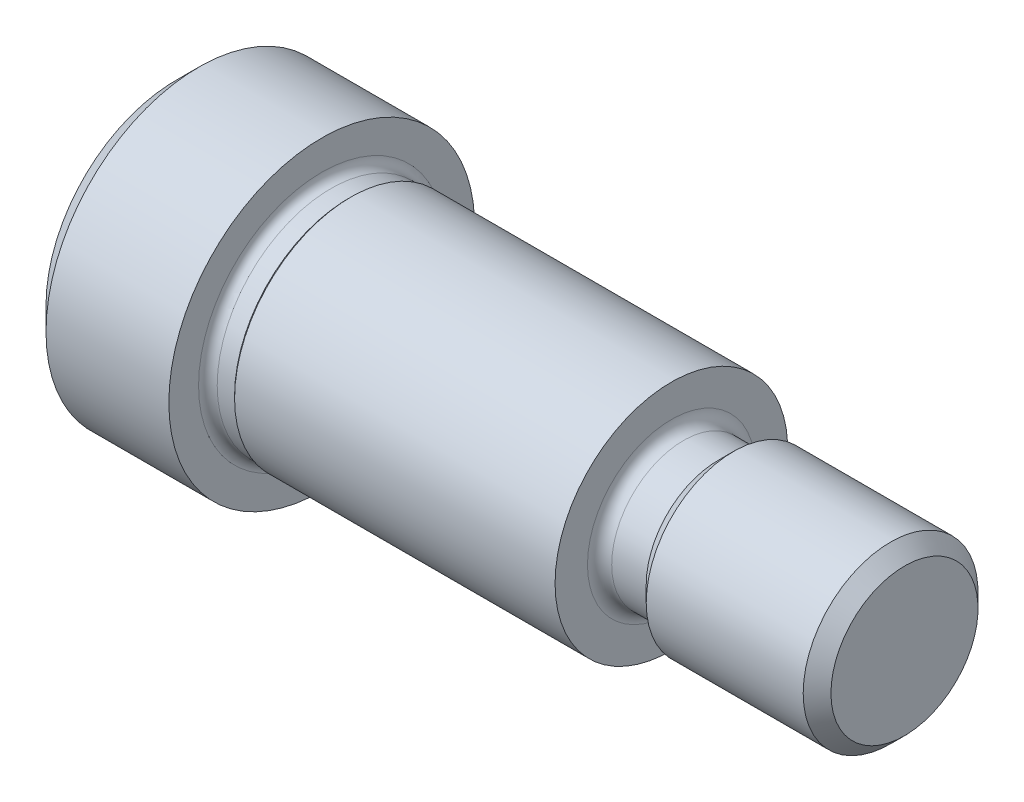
ISO-10303-21;
HEADER;
FILE_DESCRIPTION(('STEP AP214'),'2;1');
FILE_NAME('part.step','',(''),(''),'','','');
FILE_SCHEMA(('AUTOMOTIVE_DESIGN { 1 0 10303 214 1 1 1 1 }'));
ENDSEC;
DATA;
#1=APPLICATION_CONTEXT('core data for automotive mechanical design processes');
#2=APPLICATION_PROTOCOL_DEFINITION('international standard','automotive_design',2000,#1);
#3=PRODUCT_CONTEXT('',#1,'mechanical');
#4=PRODUCT('Part','Part','',(#3));
#5=PRODUCT_RELATED_PRODUCT_CATEGORY('part','',(#4));
#6=PRODUCT_DEFINITION_FORMATION('','',#4);
#7=PRODUCT_DEFINITION_CONTEXT('part definition',#1,'design');
#8=PRODUCT_DEFINITION('design','',#6,#7);
#9=PRODUCT_DEFINITION_SHAPE('','',#8);
#10=(LENGTH_UNIT() NAMED_UNIT(*) SI_UNIT(.MILLI.,.METRE.));
#11=(NAMED_UNIT(*) PLANE_ANGLE_UNIT() SI_UNIT($,.RADIAN.));
#12=(NAMED_UNIT(*) SI_UNIT($,.STERADIAN.) SOLID_ANGLE_UNIT());
#13=UNCERTAINTY_MEASURE_WITH_UNIT(LENGTH_MEASURE(1.E-05),#10,'distance_accuracy_value','');
#14=(GEOMETRIC_REPRESENTATION_CONTEXT(3) GLOBAL_UNCERTAINTY_ASSIGNED_CONTEXT((#13)) GLOBAL_UNIT_ASSIGNED_CONTEXT((#10,
#11,#12)) REPRESENTATION_CONTEXT('',''));
#15=CARTESIAN_POINT('',(0.,0.,0.));
#16=DIRECTION('',(0.,0.,1.));
#17=DIRECTION('',(1.,0.,0.));
#18=AXIS2_PLACEMENT_3D('',#15,#16,#17);
#19=CARTESIAN_POINT('',(0.,0.,0.));
#20=DIRECTION('',(-1.,0.,0.));
#21=DIRECTION('',(0.,0.,1.));
#22=AXIS2_PLACEMENT_3D('',#19,#20,#21);
#23=PLANE('',#22);
#24=CARTESIAN_POINT('',(0.,0.,0.));
#25=DIRECTION('',(-1.,0.,0.));
#26=DIRECTION('',(0.,0.,1.));
#27=AXIS2_PLACEMENT_3D('',#24,#25,#26);
#28=CIRCLE('',#27,14.1732);
#29=CARTESIAN_POINT('',(0.,0.,14.1732));
#30=VERTEX_POINT('',#29);
#31=EDGE_CURVE('E11',#30,#30,#28,.T.);
#32=ORIENTED_EDGE('',*,*,#31,.T.);
#33=EDGE_LOOP('',(#32));
#34=FACE_BOUND('',#33,.T.);
#35=DIRECTION('',(0.,-0.5,-0.866025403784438));
#36=VECTOR('',#35,1.);
#37=CARTESIAN_POINT('',(0.,-3.6661742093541,6.35000000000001));
#38=LINE('',#37,#36);
#39=CARTESIAN_POINT('',(0.,-3.6661742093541,6.35000000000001));
#40=VERTEX_POINT('',#39);
#41=CARTESIAN_POINT('',(0.,-7.33234841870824,0.));
#42=VERTEX_POINT('',#41);
#43=EDGE_CURVE('E47',#40,#42,#38,.T.);
#44=ORIENTED_EDGE('',*,*,#43,.T.);
#45=DIRECTION('',(0.,0.500000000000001,-0.866025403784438));
#46=VECTOR('',#45,1.);
#47=CARTESIAN_POINT('',(0.,-7.33234841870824,0.));
#48=LINE('',#47,#46);
#49=CARTESIAN_POINT('',(0.,-3.6661742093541,-6.35));
#50=VERTEX_POINT('',#49);
#51=EDGE_CURVE('E476',#42,#50,#48,.T.);
#52=ORIENTED_EDGE('',*,*,#51,.T.);
#53=DIRECTION('',(0.,1.,0.));
#54=VECTOR('',#53,1.);
#55=CARTESIAN_POINT('',(0.,-3.6661742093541,-6.35));
#56=LINE('',#55,#54);
#57=CARTESIAN_POINT('',(0.,3.66617420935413,-6.35));
#58=VERTEX_POINT('',#57);
#59=EDGE_CURVE('E127',#50,#58,#56,.T.);
#60=ORIENTED_EDGE('',*,*,#59,.T.);
#61=DIRECTION('',(0.,0.500000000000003,0.866025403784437));
#62=VECTOR('',#61,1.);
#63=CARTESIAN_POINT('',(0.,3.66617420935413,-6.35));
#64=LINE('',#63,#62);
#65=CARTESIAN_POINT('',(0.,7.33234841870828,0.));
#66=VERTEX_POINT('',#65);
#67=EDGE_CURVE('E479',#58,#66,#64,.T.);
#68=ORIENTED_EDGE('',*,*,#67,.T.);
#69=DIRECTION('',(0.,-0.500000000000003,0.866025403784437));
#70=VECTOR('',#69,1.);
#71=CARTESIAN_POINT('',(0.,7.33234841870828,0.));
#72=LINE('',#71,#70);
#73=CARTESIAN_POINT('',(0.,3.66617420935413,6.35000000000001));
#74=VERTEX_POINT('',#73);
#75=EDGE_CURVE('E481',#66,#74,#72,.T.);
#76=ORIENTED_EDGE('',*,*,#75,.T.);
#77=DIRECTION('',(0.,-1.,0.));
#78=VECTOR('',#77,1.);
#79=CARTESIAN_POINT('',(0.,3.66617420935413,6.35000000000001));
#80=LINE('',#79,#78);
#81=EDGE_CURVE('E483',#74,#40,#80,.T.);
#82=ORIENTED_EDGE('',*,*,#81,.T.);
#83=EDGE_LOOP('',(#44,#52,#60,#68,#76,#82));
#84=FACE_BOUND('',#83,.T.);
#85=ADVANCED_FACE('F33',(#34,#84),#23,.T.);
#86=CARTESIAN_POINT('',(0.,0.,0.));
#87=DIRECTION('',(1.,0.,0.));
#88=DIRECTION('',(0.,0.,-1.));
#89=AXIS2_PLACEMENT_3D('',#86,#87,#88);
#90=CONICAL_SURFACE('',#89,14.1732,0.785398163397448);
#91=CARTESIAN_POINT('',(2.48919999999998,0.,0.));
#92=DIRECTION('',(-1.,0.,0.));
#93=DIRECTION('',(0.,0.,1.));
#94=AXIS2_PLACEMENT_3D('',#91,#92,#93);
#95=CIRCLE('',#94,16.6624);
#96=CARTESIAN_POINT('',(2.48919999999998,0.,16.6624));
#97=VERTEX_POINT('',#96);
#98=EDGE_CURVE('E40',#97,#97,#95,.T.);
#99=ORIENTED_EDGE('',*,*,#98,.T.);
#100=EDGE_LOOP('',(#99));
#101=FACE_BOUND('',#100,.T.);
#102=ORIENTED_EDGE('',*,*,#31,.F.);
#103=EDGE_LOOP('',(#102));
#104=FACE_BOUND('',#103,.T.);
#105=ADVANCED_FACE('F179',(#101,#104),#90,.T.);
#106=CARTESIAN_POINT('',(-6.34999999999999,0.,0.));
#107=DIRECTION('',(-1.,0.,0.));
#108=DIRECTION('',(0.,0.,1.));
#109=AXIS2_PLACEMENT_3D('',#106,#107,#108);
#110=CYLINDRICAL_SURFACE('',#109,16.6624);
#111=CARTESIAN_POINT('',(15.875,0.,0.));
#112=DIRECTION('',(-1.,0.,0.));
#113=DIRECTION('',(0.,0.,1.));
#114=AXIS2_PLACEMENT_3D('',#111,#112,#113);
#115=CIRCLE('',#114,16.6624);
#116=CARTESIAN_POINT('',(15.875,0.,16.6624));
#117=VERTEX_POINT('',#116);
#118=EDGE_CURVE('E174',#117,#117,#115,.T.);
#119=ORIENTED_EDGE('',*,*,#118,.T.);
#120=EDGE_LOOP('',(#119));
#121=FACE_BOUND('',#120,.T.);
#122=ORIENTED_EDGE('',*,*,#98,.F.);
#123=EDGE_LOOP('',(#122));
#124=FACE_BOUND('',#123,.T.);
#125=ADVANCED_FACE('F182',(#121,#124),#110,.T.);
#126=CARTESIAN_POINT('',(15.875,16.6624,0.));
#127=DIRECTION('',(1.,0.,0.));
#128=DIRECTION('',(0.,0.,-1.));
#129=AXIS2_PLACEMENT_3D('',#126,#127,#128);
#130=PLANE('',#129);
#131=CARTESIAN_POINT('',(15.875,0.,0.));
#132=DIRECTION('',(-1.,0.,0.));
#133=DIRECTION('',(0.,0.,1.));
#134=AXIS2_PLACEMENT_3D('',#131,#132,#133);
#135=CIRCLE('',#134,13.4239);
#136=CARTESIAN_POINT('',(15.875,0.,13.4239));
#137=VERTEX_POINT('',#136);
#138=EDGE_CURVE('E171',#137,#137,#135,.T.);
#139=ORIENTED_EDGE('',*,*,#138,.T.);
#140=EDGE_LOOP('',(#139));
#141=FACE_BOUND('',#140,.T.);
#142=ORIENTED_EDGE('',*,*,#118,.F.);
#143=EDGE_LOOP('',(#142));
#144=FACE_BOUND('',#143,.T.);
#145=ADVANCED_FACE('F184',(#141,#144),#130,.T.);
#146=CARTESIAN_POINT('',(16.891,0.,0.));
#147=DIRECTION('',(-1.,0.,0.));
#148=DIRECTION('',(0.,0.,1.));
#149=AXIS2_PLACEMENT_3D('',#146,#147,#148);
#150=TOROIDAL_SURFACE('',#149,13.4239,1.016);
#151=ORIENTED_EDGE('',*,*,#138,.F.);
#152=EDGE_LOOP('',(#151));
#153=FACE_BOUND('',#152,.T.);
#154=CARTESIAN_POINT('',(16.891,0.,0.));
#155=DIRECTION('',(-1.,0.,0.));
#156=DIRECTION('',(0.,0.,1.));
#157=AXIS2_PLACEMENT_3D('',#154,#155,#156);
#158=CIRCLE('',#157,12.4079);
#159=CARTESIAN_POINT('',(16.891,0.,12.4079));
#160=VERTEX_POINT('',#159);
#161=EDGE_CURVE('E168',#160,#160,#158,.T.);
#162=ORIENTED_EDGE('',*,*,#161,.T.);
#163=EDGE_LOOP('',(#162));
#164=FACE_BOUND('',#163,.T.);
#165=ADVANCED_FACE('F191',(#153,#164),#150,.F.);
#166=CARTESIAN_POINT('',(-6.34999999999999,0.,0.));
#167=DIRECTION('',(-1.,0.,0.));
#168=DIRECTION('',(0.,0.,1.));
#169=AXIS2_PLACEMENT_3D('',#166,#167,#168);
#170=CYLINDRICAL_SURFACE('',#169,12.4079);
#171=CARTESIAN_POINT('',(18.7833,0.,0.));
#172=DIRECTION('',(-1.,0.,0.));
#173=DIRECTION('',(0.,0.,1.));
#174=AXIS2_PLACEMENT_3D('',#171,#172,#173);
#175=CIRCLE('',#174,12.4079);
#176=CARTESIAN_POINT('',(18.7833,0.,12.4079));
#177=VERTEX_POINT('',#176);
#178=EDGE_CURVE('E165',#177,#177,#175,.T.);
#179=ORIENTED_EDGE('',*,*,#178,.T.);
#180=EDGE_LOOP('',(#179));
#181=FACE_BOUND('',#180,.T.);
#182=ORIENTED_EDGE('',*,*,#161,.F.);
#183=EDGE_LOOP('',(#182));
#184=FACE_BOUND('',#183,.T.);
#185=ADVANCED_FACE('F224',(#181,#184),#170,.T.);
#186=CARTESIAN_POINT('',(18.7833,0.,0.));
#187=DIRECTION('',(1.,0.,0.));
#188=DIRECTION('',(0.,0.,-1.));
#189=AXIS2_PLACEMENT_3D('',#186,#187,#188);
#190=CONICAL_SURFACE('',#189,12.4079,0.785398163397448);
#191=CARTESIAN_POINT('',(19.05,0.,0.));
#192=DIRECTION('',(-1.,0.,0.));
#193=DIRECTION('',(0.,0.,1.));
#194=AXIS2_PLACEMENT_3D('',#191,#192,#193);
#195=CIRCLE('',#194,12.6746);
#196=CARTESIAN_POINT('',(19.05,0.,12.6746));
#197=VERTEX_POINT('',#196);
#198=EDGE_CURVE('E162',#197,#197,#195,.T.);
#199=ORIENTED_EDGE('',*,*,#198,.T.);
#200=EDGE_LOOP('',(#199));
#201=FACE_BOUND('',#200,.T.);
#202=ORIENTED_EDGE('',*,*,#178,.F.);
#203=EDGE_LOOP('',(#202));
#204=FACE_BOUND('',#203,.T.);
#205=ADVANCED_FACE('F234',(#201,#204),#190,.T.);
#206=CARTESIAN_POINT('',(-6.34999999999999,0.,0.));
#207=DIRECTION('',(-1.,0.,0.));
#208=DIRECTION('',(0.,0.,1.));
#209=AXIS2_PLACEMENT_3D('',#206,#207,#208);
#210=CYLINDRICAL_SURFACE('',#209,12.6746);
#211=CARTESIAN_POINT('',(53.975,0.,0.));
#212=DIRECTION('',(-1.,0.,0.));
#213=DIRECTION('',(0.,0.,1.));
#214=AXIS2_PLACEMENT_3D('',#211,#212,#213);
#215=CIRCLE('',#214,12.6746);
#216=CARTESIAN_POINT('',(53.975,0.,12.6746));
#217=VERTEX_POINT('',#216);
#218=EDGE_CURVE('E159',#217,#217,#215,.T.);
#219=ORIENTED_EDGE('',*,*,#218,.T.);
#220=EDGE_LOOP('',(#219));
#221=FACE_BOUND('',#220,.T.);
#222=ORIENTED_EDGE('',*,*,#198,.F.);
#223=EDGE_LOOP('',(#222));
#224=FACE_BOUND('',#223,.T.);
#225=ADVANCED_FACE('F244',(#221,#224),#210,.T.);
#226=CARTESIAN_POINT('',(53.975,12.6746,0.));
#227=DIRECTION('',(1.,0.,0.));
#228=DIRECTION('',(0.,0.,-1.));
#229=AXIS2_PLACEMENT_3D('',#226,#227,#228);
#230=PLANE('',#229);
#231=CARTESIAN_POINT('',(53.975,0.,0.));
#232=DIRECTION('',(-1.,0.,0.));
#233=DIRECTION('',(0.,0.,1.));
#234=AXIS2_PLACEMENT_3D('',#231,#232,#233);
#235=CIRCLE('',#234,9.144);
#236=CARTESIAN_POINT('',(53.975,0.,9.144));
#237=VERTEX_POINT('',#236);
#238=EDGE_CURVE('E156',#237,#237,#235,.T.);
#239=ORIENTED_EDGE('',*,*,#238,.T.);
#240=EDGE_LOOP('',(#239));
#241=FACE_BOUND('',#240,.T.);
#242=ORIENTED_EDGE('',*,*,#218,.F.);
#243=EDGE_LOOP('',(#242));
#244=FACE_BOUND('',#243,.T.);
#245=ADVANCED_FACE('F254',(#241,#244),#230,.T.);
#246=CARTESIAN_POINT('',(55.2958,0.,0.));
#247=DIRECTION('',(-1.,0.,0.));
#248=DIRECTION('',(0.,0.,1.));
#249=AXIS2_PLACEMENT_3D('',#246,#247,#248);
#250=TOROIDAL_SURFACE('',#249,9.144,1.3208);
#251=CARTESIAN_POINT('',(55.2958,0.,0.));
#252=DIRECTION('',(-1.,0.,0.));
#253=DIRECTION('',(0.,0.,1.));
#254=AXIS2_PLACEMENT_3D('',#251,#252,#253);
#255=CIRCLE('',#254,7.8232);
#256=CARTESIAN_POINT('',(55.2958,0.,7.8232));
#257=VERTEX_POINT('',#256);
#258=EDGE_CURVE('E153',#257,#257,#255,.T.);
#259=ORIENTED_EDGE('',*,*,#258,.T.);
#260=EDGE_LOOP('',(#259));
#261=FACE_BOUND('',#260,.T.);
#262=ORIENTED_EDGE('',*,*,#238,.F.);
#263=EDGE_LOOP('',(#262));
#264=FACE_BOUND('',#263,.T.);
#265=ADVANCED_FACE('F264',(#261,#264),#250,.F.);
#266=CARTESIAN_POINT('',(-6.34999999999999,0.,0.));
#267=DIRECTION('',(-1.,0.,0.));
#268=DIRECTION('',(0.,0.,1.));
#269=AXIS2_PLACEMENT_3D('',#266,#267,#268);
#270=CYLINDRICAL_SURFACE('',#269,7.8232);
#271=CARTESIAN_POINT('',(59.055,0.,0.));
#272=DIRECTION('',(-1.,0.,0.));
#273=DIRECTION('',(0.,0.,1.));
#274=AXIS2_PLACEMENT_3D('',#271,#272,#273);
#275=CIRCLE('',#274,7.8232);
#276=CARTESIAN_POINT('',(59.055,0.,7.8232));
#277=VERTEX_POINT('',#276);
#278=EDGE_CURVE('E150',#277,#277,#275,.T.);
#279=ORIENTED_EDGE('',*,*,#278,.T.);
#280=EDGE_LOOP('',(#279));
#281=FACE_BOUND('',#280,.T.);
#282=ORIENTED_EDGE('',*,*,#258,.F.);
#283=EDGE_LOOP('',(#282));
#284=FACE_BOUND('',#283,.T.);
#285=ADVANCED_FACE('F274',(#281,#284),#270,.T.);
#286=CARTESIAN_POINT('',(59.055,0.,0.));
#287=DIRECTION('',(1.,0.,0.));
#288=DIRECTION('',(0.,0.,-1.));
#289=AXIS2_PLACEMENT_3D('',#286,#287,#288);
#290=CONICAL_SURFACE('',#289,7.8232,0.785398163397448);
#291=CARTESIAN_POINT('',(60.7568,0.,0.));
#292=DIRECTION('',(-1.,0.,0.));
#293=DIRECTION('',(0.,0.,1.));
#294=AXIS2_PLACEMENT_3D('',#291,#292,#293);
#295=CIRCLE('',#294,9.525);
#296=CARTESIAN_POINT('',(60.7568,0.,9.525));
#297=VERTEX_POINT('',#296);
#298=EDGE_CURVE('E147',#297,#297,#295,.T.);
#299=ORIENTED_EDGE('',*,*,#298,.T.);
#300=EDGE_LOOP('',(#299));
#301=FACE_BOUND('',#300,.T.);
#302=ORIENTED_EDGE('',*,*,#278,.F.);
#303=EDGE_LOOP('',(#302));
#304=FACE_BOUND('',#303,.T.);
#305=ADVANCED_FACE('F284',(#301,#304),#290,.T.);
#306=CARTESIAN_POINT('',(-6.34999999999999,0.,0.));
#307=DIRECTION('',(-1.,0.,0.));
#308=DIRECTION('',(0.,0.,1.));
#309=AXIS2_PLACEMENT_3D('',#306,#307,#308);
#310=CYLINDRICAL_SURFACE('',#309,9.525);
#311=CARTESIAN_POINT('',(77.8624299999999,0.,0.));
#312=DIRECTION('',(-1.,0.,0.));
#313=DIRECTION('',(0.,0.,1.));
#314=AXIS2_PLACEMENT_3D('',#311,#312,#313);
#315=CIRCLE('',#314,9.525);
#316=CARTESIAN_POINT('',(77.8624299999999,0.,9.525));
#317=VERTEX_POINT('',#316);
#318=EDGE_CURVE('E144',#317,#317,#315,.T.);
#319=ORIENTED_EDGE('',*,*,#318,.T.);
#320=EDGE_LOOP('',(#319));
#321=FACE_BOUND('',#320,.T.);
#322=ORIENTED_EDGE('',*,*,#298,.F.);
#323=EDGE_LOOP('',(#322));
#324=FACE_BOUND('',#323,.T.);
#325=ADVANCED_FACE('F294',(#321,#324),#310,.T.);
#326=CARTESIAN_POINT('',(77.8624299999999,0.,0.));
#327=DIRECTION('',(-1.,0.,0.));
#328=DIRECTION('',(0.,0.,1.));
#329=AXIS2_PLACEMENT_3D('',#326,#327,#328);
#330=CONICAL_SURFACE('',#329,9.525,0.785398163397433);
#331=CARTESIAN_POINT('',(79.3749999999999,0.,0.));
#332=DIRECTION('',(-1.,0.,0.));
#333=DIRECTION('',(0.,0.,1.));
#334=AXIS2_PLACEMENT_3D('',#331,#332,#333);
#335=CIRCLE('',#334,8.01243);
#336=CARTESIAN_POINT('',(79.3749999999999,0.,8.01243));
#337=VERTEX_POINT('',#336);
#338=EDGE_CURVE('E140',#337,#337,#335,.T.);
#339=ORIENTED_EDGE('',*,*,#338,.T.);
#340=EDGE_LOOP('',(#339));
#341=FACE_BOUND('',#340,.T.);
#342=ORIENTED_EDGE('',*,*,#318,.F.);
#343=EDGE_LOOP('',(#342));
#344=FACE_BOUND('',#343,.T.);
#345=ADVANCED_FACE('F304',(#341,#344),#330,.T.);
#346=CARTESIAN_POINT('',(79.3749999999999,8.01243,0.));
#347=DIRECTION('',(1.,0.,0.));
#348=DIRECTION('',(0.,0.,-1.));
#349=AXIS2_PLACEMENT_3D('',#346,#347,#348);
#350=PLANE('',#349);
#351=ORIENTED_EDGE('',*,*,#338,.F.);
#352=EDGE_LOOP('',(#351));
#353=FACE_BOUND('',#352,.T.);
#354=ADVANCED_FACE('F313',(#353),#350,.T.);
#355=CARTESIAN_POINT('',(9.525,-7.33234841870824,0.));
#356=DIRECTION('',(0.,0.866025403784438,0.500000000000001));
#357=DIRECTION('',(0.,-0.500000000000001,0.866025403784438));
#358=AXIS2_PLACEMENT_3D('',#355,#356,#357);
#359=PLANE('',#358);
#360=DIRECTION('',(0.,0.500000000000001,-0.866025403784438));
#361=VECTOR('',#360,1.);
#362=CARTESIAN_POINT('',(9.525,-7.33234841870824,0.));
#363=LINE('',#362,#361);
#364=CARTESIAN_POINT('',(9.525,-7.33234841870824,0.));
#365=VERTEX_POINT('',#364);
#366=CARTESIAN_POINT('',(9.525,-5.49926131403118,-3.17500000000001));
#367=VERTEX_POINT('',#366);
#368=EDGE_CURVE('E55',#365,#367,#363,.T.);
#369=ORIENTED_EDGE('',*,*,#368,.T.);
#370=CARTESIAN_POINT('',(9.525,-3.6661742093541,-6.35));
#371=VERTEX_POINT('',#370);
#372=EDGE_CURVE('E105',#367,#371,#363,.T.);
#373=ORIENTED_EDGE('',*,*,#372,.T.);
#374=DIRECTION('',(-1.,0.,0.));
#375=VECTOR('',#374,1.);
#376=CARTESIAN_POINT('',(9.525,-3.6661742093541,-6.35));
#377=LINE('',#376,#375);
#378=EDGE_CURVE('E109',#371,#50,#377,.T.);
#379=ORIENTED_EDGE('',*,*,#378,.T.);
#380=ORIENTED_EDGE('',*,*,#51,.F.);
#381=DIRECTION('',(-1.,0.,0.));
#382=VECTOR('',#381,1.);
#383=CARTESIAN_POINT('',(9.525,-7.33234841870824,0.));
#384=LINE('',#383,#382);
#385=EDGE_CURVE('E475',#365,#42,#384,.T.);
#386=ORIENTED_EDGE('',*,*,#385,.F.);
#387=EDGE_LOOP('',(#369,#373,#379,#380,#386));
#388=FACE_BOUND('',#387,.T.);
#389=ADVANCED_FACE('F107',(#388),#359,.T.);
#390=CARTESIAN_POINT('',(9.525,-3.6661742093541,-6.35));
#391=DIRECTION('',(0.,0.,1.));
#392=DIRECTION('',(0.,-1.,0.));
#393=AXIS2_PLACEMENT_3D('',#390,#391,#392);
#394=PLANE('',#393);
#395=DIRECTION('',(0.,1.,0.));
#396=VECTOR('',#395,1.);
#397=CARTESIAN_POINT('',(9.525,-3.6661742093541,-6.35));
#398=LINE('',#397,#396);
#399=CARTESIAN_POINT('',(9.525,0.,-6.35));
#400=VERTEX_POINT('',#399);
#401=EDGE_CURVE('E114',#371,#400,#398,.T.);
#402=ORIENTED_EDGE('',*,*,#401,.T.);
#403=CARTESIAN_POINT('',(9.525,3.66617420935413,-6.35));
#404=VERTEX_POINT('',#403);
#405=EDGE_CURVE('E122',#400,#404,#398,.T.);
#406=ORIENTED_EDGE('',*,*,#405,.T.);
#407=DIRECTION('',(-1.,0.,0.));
#408=VECTOR('',#407,1.);
#409=CARTESIAN_POINT('',(9.525,3.66617420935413,-6.35));
#410=LINE('',#409,#408);
#411=EDGE_CURVE('E129',#404,#58,#410,.T.);
#412=ORIENTED_EDGE('',*,*,#411,.T.);
#413=ORIENTED_EDGE('',*,*,#59,.F.);
#414=ORIENTED_EDGE('',*,*,#378,.F.);
#415=EDGE_LOOP('',(#402,#406,#412,#413,#414));
#416=FACE_BOUND('',#415,.T.);
#417=ADVANCED_FACE('F125',(#416),#394,.T.);
#418=CARTESIAN_POINT('',(9.525,3.66617420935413,-6.35));
#419=DIRECTION('',(0.,-0.866025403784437,0.500000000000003));
#420=DIRECTION('',(0.,-0.500000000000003,-0.866025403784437));
#421=AXIS2_PLACEMENT_3D('',#418,#419,#420);
#422=PLANE('',#421);
#423=DIRECTION('',(0.,0.500000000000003,0.866025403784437));
#424=VECTOR('',#423,1.);
#425=CARTESIAN_POINT('',(9.525,3.66617420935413,-6.35));
#426=LINE('',#425,#424);
#427=CARTESIAN_POINT('',(9.525,5.49926131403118,-3.17500000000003));
#428=VERTEX_POINT('',#427);
#429=EDGE_CURVE('E499',#404,#428,#426,.T.);
#430=ORIENTED_EDGE('',*,*,#429,.T.);
#431=CARTESIAN_POINT('',(9.525,7.33234841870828,0.));
#432=VERTEX_POINT('',#431);
#433=EDGE_CURVE('E121',#428,#432,#426,.T.);
#434=ORIENTED_EDGE('',*,*,#433,.T.);
#435=DIRECTION('',(-1.,0.,0.));
#436=VECTOR('',#435,1.);
#437=CARTESIAN_POINT('',(9.525,7.33234841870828,0.));
#438=LINE('',#437,#436);
#439=EDGE_CURVE('E135',#432,#66,#438,.T.);
#440=ORIENTED_EDGE('',*,*,#439,.T.);
#441=ORIENTED_EDGE('',*,*,#67,.F.);
#442=ORIENTED_EDGE('',*,*,#411,.F.);
#443=EDGE_LOOP('',(#430,#434,#440,#441,#442));
#444=FACE_BOUND('',#443,.T.);
#445=ADVANCED_FACE('F337',(#444),#422,.T.);
#446=CARTESIAN_POINT('',(9.525,7.33234841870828,0.));
#447=DIRECTION('',(0.,-0.866025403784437,-0.500000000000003));
#448=DIRECTION('',(0.,0.500000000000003,-0.866025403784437));
#449=AXIS2_PLACEMENT_3D('',#446,#447,#448);
#450=PLANE('',#449);
#451=DIRECTION('',(0.,-0.500000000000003,0.866025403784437));
#452=VECTOR('',#451,1.);
#453=CARTESIAN_POINT('',(9.525,7.33234841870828,0.));
#454=LINE('',#453,#452);
#455=CARTESIAN_POINT('',(9.525,5.49926131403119,3.17500000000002));
#456=VERTEX_POINT('',#455);
#457=EDGE_CURVE('E464',#432,#456,#454,.T.);
#458=ORIENTED_EDGE('',*,*,#457,.T.);
#459=CARTESIAN_POINT('',(9.525,3.66617420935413,6.35000000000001));
#460=VERTEX_POINT('',#459);
#461=EDGE_CURVE('E455',#456,#460,#454,.T.);
#462=ORIENTED_EDGE('',*,*,#461,.T.);
#463=DIRECTION('',(-1.,0.,0.));
#464=VECTOR('',#463,1.);
#465=CARTESIAN_POINT('',(9.525,3.66617420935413,6.35000000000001));
#466=LINE('',#465,#464);
#467=EDGE_CURVE('E469',#460,#74,#466,.T.);
#468=ORIENTED_EDGE('',*,*,#467,.T.);
#469=ORIENTED_EDGE('',*,*,#75,.F.);
#470=ORIENTED_EDGE('',*,*,#439,.F.);
#471=EDGE_LOOP('',(#458,#462,#468,#469,#470));
#472=FACE_BOUND('',#471,.T.);
#473=ADVANCED_FACE('F344',(#472),#450,.T.);
#474=CARTESIAN_POINT('',(9.525,3.66617420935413,6.35000000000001));
#475=DIRECTION('',(0.,0.,-1.));
#476=DIRECTION('',(0.,1.,0.));
#477=AXIS2_PLACEMENT_3D('',#474,#475,#476);
#478=PLANE('',#477);
#479=DIRECTION('',(0.,-1.,0.));
#480=VECTOR('',#479,1.);
#481=CARTESIAN_POINT('',(9.525,3.66617420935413,6.35000000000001));
#482=LINE('',#481,#480);
#483=CARTESIAN_POINT('',(9.525,0.,6.35000000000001));
#484=VERTEX_POINT('',#483);
#485=EDGE_CURVE('E454',#460,#484,#482,.T.);
#486=ORIENTED_EDGE('',*,*,#485,.T.);
#487=CARTESIAN_POINT('',(9.525,-3.6661742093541,6.35000000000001));
#488=VERTEX_POINT('',#487);
#489=EDGE_CURVE('E458',#484,#488,#482,.T.);
#490=ORIENTED_EDGE('',*,*,#489,.T.);
#491=DIRECTION('',(-1.,0.,0.));
#492=VECTOR('',#491,1.);
#493=CARTESIAN_POINT('',(9.525,-3.6661742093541,6.35000000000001));
#494=LINE('',#493,#492);
#495=EDGE_CURVE('E488',#488,#40,#494,.T.);
#496=ORIENTED_EDGE('',*,*,#495,.T.);
#497=ORIENTED_EDGE('',*,*,#81,.F.);
#498=ORIENTED_EDGE('',*,*,#467,.F.);
#499=EDGE_LOOP('',(#486,#490,#496,#497,#498));
#500=FACE_BOUND('',#499,.T.);
#501=ADVANCED_FACE('F352',(#500),#478,.T.);
#502=CARTESIAN_POINT('',(9.525,-3.6661742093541,6.35000000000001));
#503=DIRECTION('',(0.,0.866025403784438,-0.5));
#504=DIRECTION('',(0.,0.5,0.866025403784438));
#505=AXIS2_PLACEMENT_3D('',#502,#503,#504);
#506=PLANE('',#505);
#507=DIRECTION('',(0.,-0.5,-0.866025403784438));
#508=VECTOR('',#507,1.);
#509=CARTESIAN_POINT('',(9.525,-3.6661742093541,6.35000000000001));
#510=LINE('',#509,#508);
#511=CARTESIAN_POINT('',(9.525,-5.49926131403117,3.175));
#512=VERTEX_POINT('',#511);
#513=EDGE_CURVE('E461',#488,#512,#510,.T.);
#514=ORIENTED_EDGE('',*,*,#513,.T.);
#515=EDGE_CURVE('E470',#512,#365,#510,.T.);
#516=ORIENTED_EDGE('',*,*,#515,.T.);
#517=ORIENTED_EDGE('',*,*,#385,.T.);
#518=ORIENTED_EDGE('',*,*,#43,.F.);
#519=ORIENTED_EDGE('',*,*,#495,.F.);
#520=EDGE_LOOP('',(#514,#516,#517,#518,#519));
#521=FACE_BOUND('',#520,.T.);
#522=ADVANCED_FACE('F360',(#521),#506,.T.);
#523=CARTESIAN_POINT('',(9.525,0.,-12.6999999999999));
#524=DIRECTION('',(1.,0.,0.));
#525=DIRECTION('',(0.,0.,-1.));
#526=AXIS2_PLACEMENT_3D('',#523,#524,#525);
#527=PLANE('',#526);
#528=CARTESIAN_POINT('',(9.525,0.,0.));
#529=DIRECTION('',(-1.,0.,0.));
#530=DIRECTION('',(0.,0.,1.));
#531=AXIS2_PLACEMENT_3D('',#528,#529,#530);
#532=CIRCLE('',#531,6.35);
#533=EDGE_CURVE('E500',#428,#400,#532,.T.);
#534=ORIENTED_EDGE('',*,*,#533,.F.);
#535=ORIENTED_EDGE('',*,*,#429,.F.);
#536=ORIENTED_EDGE('',*,*,#405,.F.);
#537=EDGE_LOOP('',(#534,#535,#536));
#538=FACE_BOUND('',#537,.T.);
#539=ADVANCED_FACE('F368',(#538),#527,.F.);
#540=EDGE_CURVE('E141',#456,#428,#532,.T.);
#541=ORIENTED_EDGE('',*,*,#540,.F.);
#542=ORIENTED_EDGE('',*,*,#457,.F.);
#543=ORIENTED_EDGE('',*,*,#433,.F.);
#544=EDGE_LOOP('',(#541,#542,#543));
#545=FACE_BOUND('',#544,.T.);
#546=ADVANCED_FACE('F376',(#545),#527,.F.);
#547=EDGE_CURVE('E134',#484,#456,#532,.T.);
#548=ORIENTED_EDGE('',*,*,#547,.F.);
#549=ORIENTED_EDGE('',*,*,#485,.F.);
#550=ORIENTED_EDGE('',*,*,#461,.F.);
#551=EDGE_LOOP('',(#548,#549,#550));
#552=FACE_BOUND('',#551,.T.);
#553=ADVANCED_FACE('F384',(#552),#527,.F.);
#554=EDGE_CURVE('E128',#512,#484,#532,.T.);
#555=ORIENTED_EDGE('',*,*,#554,.F.);
#556=ORIENTED_EDGE('',*,*,#513,.F.);
#557=ORIENTED_EDGE('',*,*,#489,.F.);
#558=EDGE_LOOP('',(#555,#556,#557));
#559=FACE_BOUND('',#558,.T.);
#560=ADVANCED_FACE('F391',(#559),#527,.F.);
#561=EDGE_CURVE('E132',#367,#512,#532,.T.);
#562=ORIENTED_EDGE('',*,*,#561,.F.);
#563=ORIENTED_EDGE('',*,*,#368,.F.);
#564=ORIENTED_EDGE('',*,*,#515,.F.);
#565=EDGE_LOOP('',(#562,#563,#564));
#566=FACE_BOUND('',#565,.T.);
#567=ADVANCED_FACE('F398',(#566),#527,.F.);
#568=EDGE_CURVE('E117',#400,#367,#532,.T.);
#569=ORIENTED_EDGE('',*,*,#568,.F.);
#570=ORIENTED_EDGE('',*,*,#401,.F.);
#571=ORIENTED_EDGE('',*,*,#372,.F.);
#572=EDGE_LOOP('',(#569,#570,#571));
#573=FACE_BOUND('',#572,.T.);
#574=ADVANCED_FACE('F115',(#573),#527,.F.);
#575=CARTESIAN_POINT('',(13.1911742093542,0.,0.));
#576=DIRECTION('',(-1.,0.,0.));
#577=DIRECTION('',(0.,0.,1.));
#578=AXIS2_PLACEMENT_3D('',#575,#576,#577);
#579=CONICAL_SURFACE('',#578,0.,1.04719755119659);
#580=ORIENTED_EDGE('',*,*,#547,.T.);
#581=ORIENTED_EDGE('',*,*,#540,.T.);
#582=ORIENTED_EDGE('',*,*,#533,.T.);
#583=ORIENTED_EDGE('',*,*,#568,.T.);
#584=ORIENTED_EDGE('',*,*,#561,.T.);
#585=ORIENTED_EDGE('',*,*,#554,.T.);
#586=EDGE_LOOP('',(#580,#581,#582,#583,#584,#585));
#587=FACE_BOUND('',#586,.T.);
#588=CARTESIAN_POINT('',(13.1911742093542,0.,0.));
#589=VERTEX_POINT('',#588);
#590=VERTEX_LOOP('',#589);
#591=FACE_BOUND('',#590,.T.);
#592=ADVANCED_FACE('F411',(#587,#591),#579,.F.);
#593=CLOSED_SHELL('',(#85,#105,#125,#145,#165,#185,#205,#225,#245,#265,#285,#305,#325,#345,#354,
#389,#417,#445,#473,#501,#522,#539,#546,#553,#560,#567,#574,#592));
#594=MANIFOLD_SOLID_BREP('B2',#593);
#595=ADVANCED_BREP_SHAPE_REPRESENTATION('',(#18,#594),#14);
#596=SHAPE_DEFINITION_REPRESENTATION(#9,#595);
ENDSEC;
END-ISO-10303-21;
